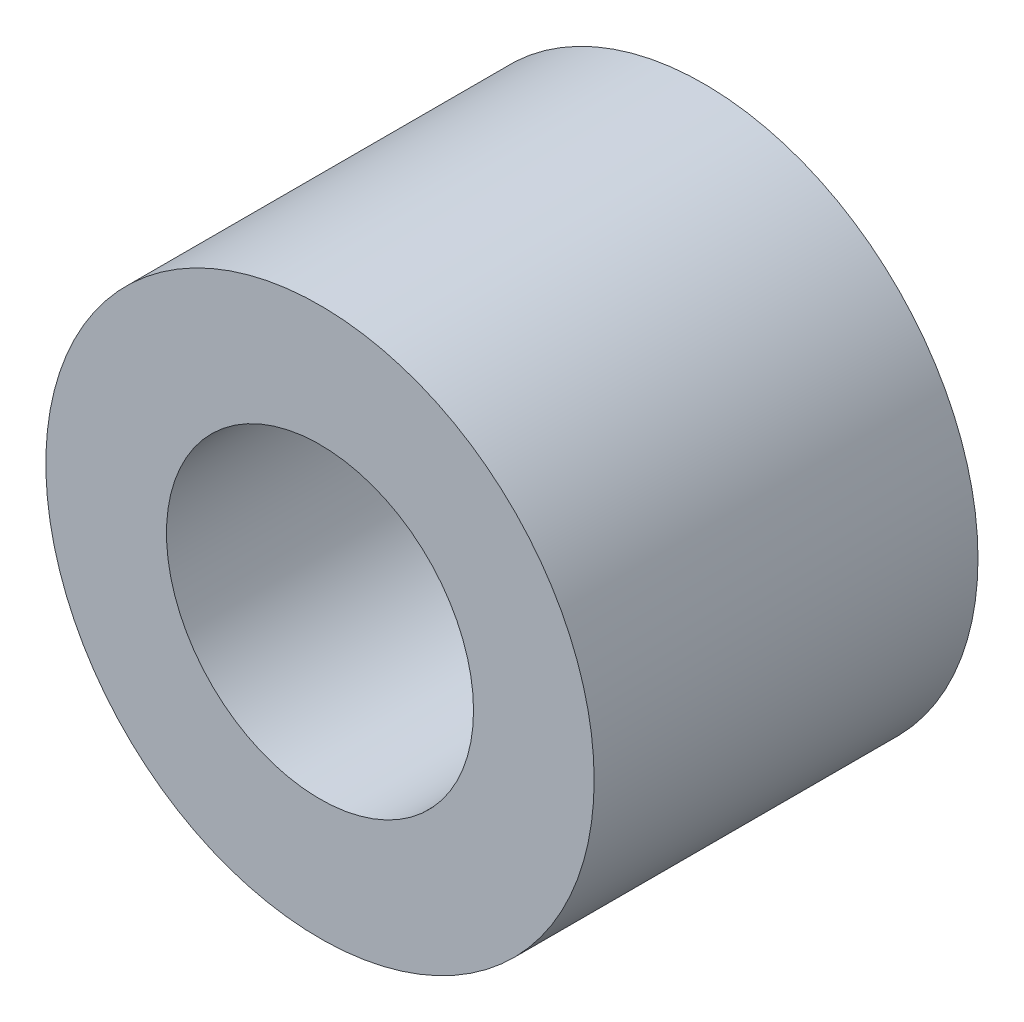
from build123d import *

# Parameters (mm, degrees)
SKETCH1_R                       = 2.54
BASE_EXTRUDE_DEPTH              = 3.556
F_4_40_TAPPED_HOLE1_D           = 2.2606
F_4_40_TAPPED_HOLE1_CBORE_D     = 2.8448
F_4_40_TAPPED_HOLE1_CBORE_DEPTH = 5.6896


with BuildPart() as part:
    # Sketch1 → Base-Extrude (new body)
    with BuildSketch(Plane.XY):
        Circle(SKETCH1_R)
    extrude(amount=-BASE_EXTRUDE_DEPTH)

    # 4-40 Tapped Hole1 (through all)
    with Locations(Plane.XY):
        with Locations((0, 0)):
            CounterBoreHole(F_4_40_TAPPED_HOLE1_D / 2, F_4_40_TAPPED_HOLE1_CBORE_D / 2, F_4_40_TAPPED_HOLE1_CBORE_DEPTH)


solid = part.part
